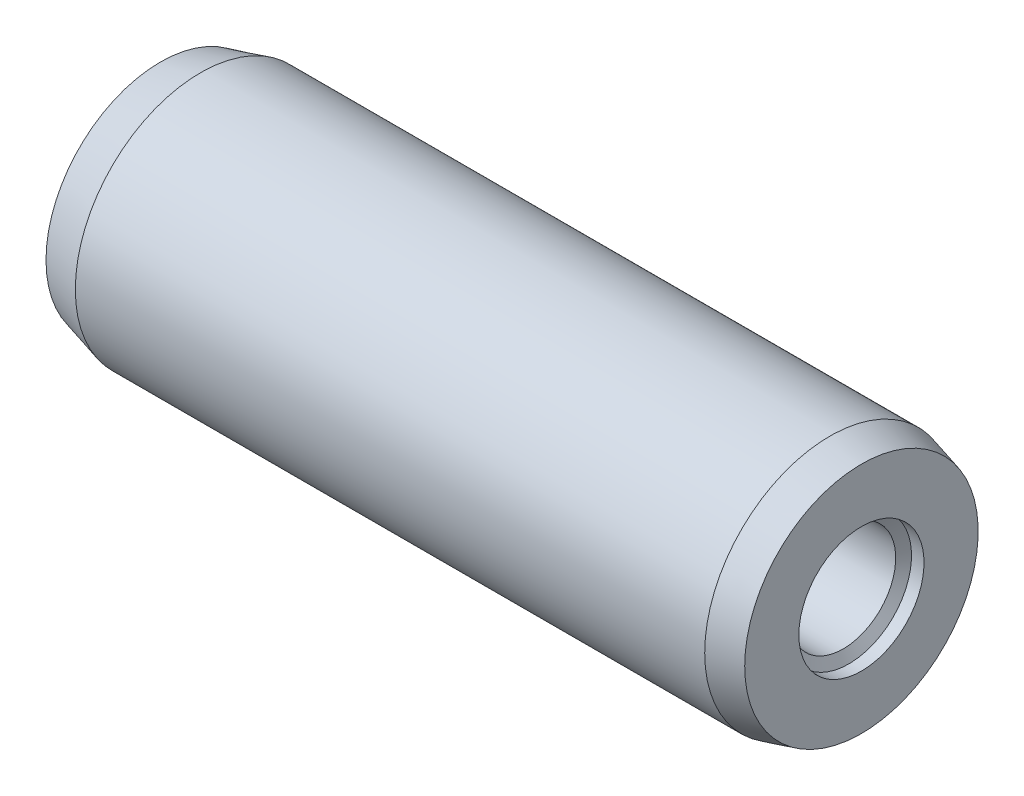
ISO-10303-21;
HEADER;
FILE_DESCRIPTION(('STEP AP214'),'2;1');
FILE_NAME('part.step','',(''),(''),'','','');
FILE_SCHEMA(('AUTOMOTIVE_DESIGN { 1 0 10303 214 1 1 1 1 }'));
ENDSEC;
DATA;
#1=APPLICATION_CONTEXT('core data for automotive mechanical design processes');
#2=APPLICATION_PROTOCOL_DEFINITION('international standard','automotive_design',2000,#1);
#3=PRODUCT_CONTEXT('',#1,'mechanical');
#4=PRODUCT('Part','Part','',(#3));
#5=PRODUCT_RELATED_PRODUCT_CATEGORY('part','',(#4));
#6=PRODUCT_DEFINITION_FORMATION('','',#4);
#7=PRODUCT_DEFINITION_CONTEXT('part definition',#1,'design');
#8=PRODUCT_DEFINITION('design','',#6,#7);
#9=PRODUCT_DEFINITION_SHAPE('','',#8);
#10=(LENGTH_UNIT() NAMED_UNIT(*) SI_UNIT(.MILLI.,.METRE.));
#11=(NAMED_UNIT(*) PLANE_ANGLE_UNIT() SI_UNIT($,.RADIAN.));
#12=(NAMED_UNIT(*) SI_UNIT($,.STERADIAN.) SOLID_ANGLE_UNIT());
#13=UNCERTAINTY_MEASURE_WITH_UNIT(LENGTH_MEASURE(1.E-05),#10,'distance_accuracy_value','');
#14=(GEOMETRIC_REPRESENTATION_CONTEXT(3) GLOBAL_UNCERTAINTY_ASSIGNED_CONTEXT((#13)) GLOBAL_UNIT_ASSIGNED_CONTEXT((#10,
#11,#12)) REPRESENTATION_CONTEXT('',''));
#15=CARTESIAN_POINT('',(0.,0.,0.));
#16=DIRECTION('',(0.,0.,1.));
#17=DIRECTION('',(1.,0.,0.));
#18=AXIS2_PLACEMENT_3D('',#15,#16,#17);
#19=CARTESIAN_POINT('',(0.,0.,0.));
#20=DIRECTION('',(1.,0.,0.));
#21=DIRECTION('',(0.,0.,-1.));
#22=AXIS2_PLACEMENT_3D('',#19,#20,#21);
#23=PLANE('',#22);
#24=CARTESIAN_POINT('',(0.,0.,0.));
#25=DIRECTION('',(-1.,0.,0.));
#26=DIRECTION('',(0.,0.,1.));
#27=AXIS2_PLACEMENT_3D('',#24,#25,#26);
#28=CIRCLE('',#27,22.8564064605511);
#29=CARTESIAN_POINT('',(0.,0.,22.8564064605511));
#30=VERTEX_POINT('',#29);
#31=EDGE_CURVE('E11',#30,#30,#28,.T.);
#32=ORIENTED_EDGE('',*,*,#31,.T.);
#33=EDGE_LOOP('',(#32));
#34=FACE_BOUND('',#33,.T.);
#35=ADVANCED_FACE('F35',(#34),#23,.F.);
#36=CARTESIAN_POINT('',(8.,0.,0.));
#37=DIRECTION('',(1.,0.,0.));
#38=DIRECTION('',(0.,0.,-1.));
#39=AXIS2_PLACEMENT_3D('',#36,#37,#38);
#40=CONICAL_SURFACE('',#39,25.,0.261799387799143);
#41=ORIENTED_EDGE('',*,*,#31,.F.);
#42=EDGE_LOOP('',(#41));
#43=FACE_BOUND('',#42,.T.);
#44=CARTESIAN_POINT('',(8.,0.,0.));
#45=DIRECTION('',(-1.,0.,0.));
#46=DIRECTION('',(0.,0.,1.));
#47=AXIS2_PLACEMENT_3D('',#44,#45,#46);
#48=CIRCLE('',#47,25.);
#49=CARTESIAN_POINT('',(8.,0.,25.));
#50=VERTEX_POINT('',#49);
#51=EDGE_CURVE('E41',#50,#50,#48,.T.);
#52=ORIENTED_EDGE('',*,*,#51,.T.);
#53=EDGE_LOOP('',(#52));
#54=FACE_BOUND('',#53,.T.);
#55=ADVANCED_FACE('F57',(#43,#54),#40,.T.);
#56=CARTESIAN_POINT('',(-10.,0.,0.));
#57=DIRECTION('',(-1.,0.,0.));
#58=DIRECTION('',(0.,0.,1.));
#59=AXIS2_PLACEMENT_3D('',#56,#57,#58);
#60=CYLINDRICAL_SURFACE('',#59,25.);
#61=ORIENTED_EDGE('',*,*,#51,.F.);
#62=EDGE_LOOP('',(#61));
#63=FACE_BOUND('',#62,.T.);
#64=CARTESIAN_POINT('',(133.7,0.,0.));
#65=DIRECTION('',(-1.,0.,0.));
#66=DIRECTION('',(0.,0.,1.));
#67=AXIS2_PLACEMENT_3D('',#64,#65,#66);
#68=CIRCLE('',#67,25.);
#69=CARTESIAN_POINT('',(133.7,0.,25.));
#70=VERTEX_POINT('',#69);
#71=EDGE_CURVE('E69',#70,#70,#68,.T.);
#72=ORIENTED_EDGE('',*,*,#71,.T.);
#73=EDGE_LOOP('',(#72));
#74=FACE_BOUND('',#73,.T.);
#75=ADVANCED_FACE('F62',(#63,#74),#60,.T.);
#76=CARTESIAN_POINT('',(140.,0.,0.));
#77=DIRECTION('',(-1.,0.,0.));
#78=DIRECTION('',(0.,0.,1.));
#79=AXIS2_PLACEMENT_3D('',#76,#77,#78);
#80=CONICAL_SURFACE('',#79,23.3119200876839,0.261799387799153);
#81=ORIENTED_EDGE('',*,*,#71,.F.);
#82=EDGE_LOOP('',(#81));
#83=FACE_BOUND('',#82,.T.);
#84=CARTESIAN_POINT('',(140.,0.,0.));
#85=DIRECTION('',(-1.,0.,0.));
#86=DIRECTION('',(0.,0.,1.));
#87=AXIS2_PLACEMENT_3D('',#84,#85,#86);
#88=CIRCLE('',#87,23.3119200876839);
#89=CARTESIAN_POINT('',(140.,0.,23.3119200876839));
#90=VERTEX_POINT('',#89);
#91=EDGE_CURVE('E71',#90,#90,#88,.T.);
#92=ORIENTED_EDGE('',*,*,#91,.T.);
#93=EDGE_LOOP('',(#92));
#94=FACE_BOUND('',#93,.T.);
#95=ADVANCED_FACE('F104',(#83,#94),#80,.T.);
#96=CARTESIAN_POINT('',(140.,23.3119200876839,0.));
#97=DIRECTION('',(-1.,0.,0.));
#98=DIRECTION('',(0.,0.,1.));
#99=AXIS2_PLACEMENT_3D('',#96,#97,#98);
#100=PLANE('',#99);
#101=ORIENTED_EDGE('',*,*,#91,.F.);
#102=EDGE_LOOP('',(#101));
#103=FACE_BOUND('',#102,.T.);
#104=CARTESIAN_POINT('',(140.,0.,0.));
#105=DIRECTION('',(-1.,0.,0.));
#106=DIRECTION('',(0.,0.,1.));
#107=AXIS2_PLACEMENT_3D('',#104,#105,#106);
#108=CIRCLE('',#107,12.5);
#109=CARTESIAN_POINT('',(140.,0.,12.5));
#110=VERTEX_POINT('',#109);
#111=EDGE_CURVE('E76',#110,#110,#108,.T.);
#112=ORIENTED_EDGE('',*,*,#111,.T.);
#113=EDGE_LOOP('',(#112));
#114=FACE_BOUND('',#113,.T.);
#115=ADVANCED_FACE('F97',(#103,#114),#100,.F.);
#116=CARTESIAN_POINT('',(-10.,0.,0.));
#117=DIRECTION('',(-1.,0.,0.));
#118=DIRECTION('',(0.,0.,1.));
#119=AXIS2_PLACEMENT_3D('',#116,#117,#118);
#120=CYLINDRICAL_SURFACE('',#119,12.5);
#121=ORIENTED_EDGE('',*,*,#111,.F.);
#122=EDGE_LOOP('',(#121));
#123=FACE_BOUND('',#122,.T.);
#124=CARTESIAN_POINT('',(137.5,0.,0.));
#125=DIRECTION('',(-1.,0.,0.));
#126=DIRECTION('',(0.,0.,1.));
#127=AXIS2_PLACEMENT_3D('',#124,#125,#126);
#128=CIRCLE('',#127,12.5);
#129=CARTESIAN_POINT('',(137.5,0.,12.5));
#130=VERTEX_POINT('',#129);
#131=EDGE_CURVE('E79',#130,#130,#128,.T.);
#132=ORIENTED_EDGE('',*,*,#131,.T.);
#133=EDGE_LOOP('',(#132));
#134=FACE_BOUND('',#133,.T.);
#135=ADVANCED_FACE('F91',(#123,#134),#120,.F.);
#136=CARTESIAN_POINT('',(136.345299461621,0.,0.));
#137=DIRECTION('',(1.,0.,0.));
#138=DIRECTION('',(0.,0.,-1.));
#139=AXIS2_PLACEMENT_3D('',#136,#137,#138);
#140=CONICAL_SURFACE('',#139,10.5,1.0471975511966);
#141=ORIENTED_EDGE('',*,*,#131,.F.);
#142=EDGE_LOOP('',(#141));
#143=FACE_BOUND('',#142,.T.);
#144=CARTESIAN_POINT('',(136.345299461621,0.,0.));
#145=DIRECTION('',(-1.,0.,0.));
#146=DIRECTION('',(0.,0.,1.));
#147=AXIS2_PLACEMENT_3D('',#144,#145,#146);
#148=CIRCLE('',#147,10.5);
#149=CARTESIAN_POINT('',(136.345299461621,0.,10.5));
#150=VERTEX_POINT('',#149);
#151=EDGE_CURVE('E82',#150,#150,#148,.T.);
#152=ORIENTED_EDGE('',*,*,#151,.T.);
#153=EDGE_LOOP('',(#152));
#154=FACE_BOUND('',#153,.T.);
#155=ADVANCED_FACE('F52',(#143,#154),#140,.F.);
#156=CARTESIAN_POINT('',(-10.,0.,0.));
#157=DIRECTION('',(-1.,0.,0.));
#158=DIRECTION('',(0.,0.,1.));
#159=AXIS2_PLACEMENT_3D('',#156,#157,#158);
#160=CYLINDRICAL_SURFACE('',#159,10.5);
#161=ORIENTED_EDGE('',*,*,#151,.F.);
#162=EDGE_LOOP('',(#161));
#163=FACE_BOUND('',#162,.T.);
#164=CARTESIAN_POINT('',(90.,0.,0.));
#165=DIRECTION('',(-1.,0.,0.));
#166=DIRECTION('',(0.,0.,1.));
#167=AXIS2_PLACEMENT_3D('',#164,#165,#166);
#168=CIRCLE('',#167,10.5);
#169=CARTESIAN_POINT('',(90.,0.,10.5));
#170=VERTEX_POINT('',#169);
#171=EDGE_CURVE('E85',#170,#170,#168,.T.);
#172=ORIENTED_EDGE('',*,*,#171,.T.);
#173=EDGE_LOOP('',(#172));
#174=FACE_BOUND('',#173,.T.);
#175=ADVANCED_FACE('F46',(#163,#174),#160,.F.);
#176=CARTESIAN_POINT('',(83.6909635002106,0.,0.));
#177=DIRECTION('',(1.,0.,0.));
#178=DIRECTION('',(0.,0.,-1.));
#179=AXIS2_PLACEMENT_3D('',#176,#177,#178);
#180=CONICAL_SURFACE('',#179,0.,1.02974425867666);
#181=ORIENTED_EDGE('',*,*,#171,.F.);
#182=EDGE_LOOP('',(#181));
#183=FACE_BOUND('',#182,.T.);
#184=CARTESIAN_POINT('',(83.6909635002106,0.,0.));
#185=VERTEX_POINT('',#184);
#186=VERTEX_LOOP('',#185);
#187=FACE_BOUND('',#186,.T.);
#188=ADVANCED_FACE('F44',(#183,#187),#180,.F.);
#189=CLOSED_SHELL('',(#35,#55,#75,#95,#115,#135,#155,#175,#188));
#190=MANIFOLD_SOLID_BREP('B2',#189);
#191=ADVANCED_BREP_SHAPE_REPRESENTATION('',(#18,#190),#14);
#192=SHAPE_DEFINITION_REPRESENTATION(#9,#191);
ENDSEC;
END-ISO-10303-21;
